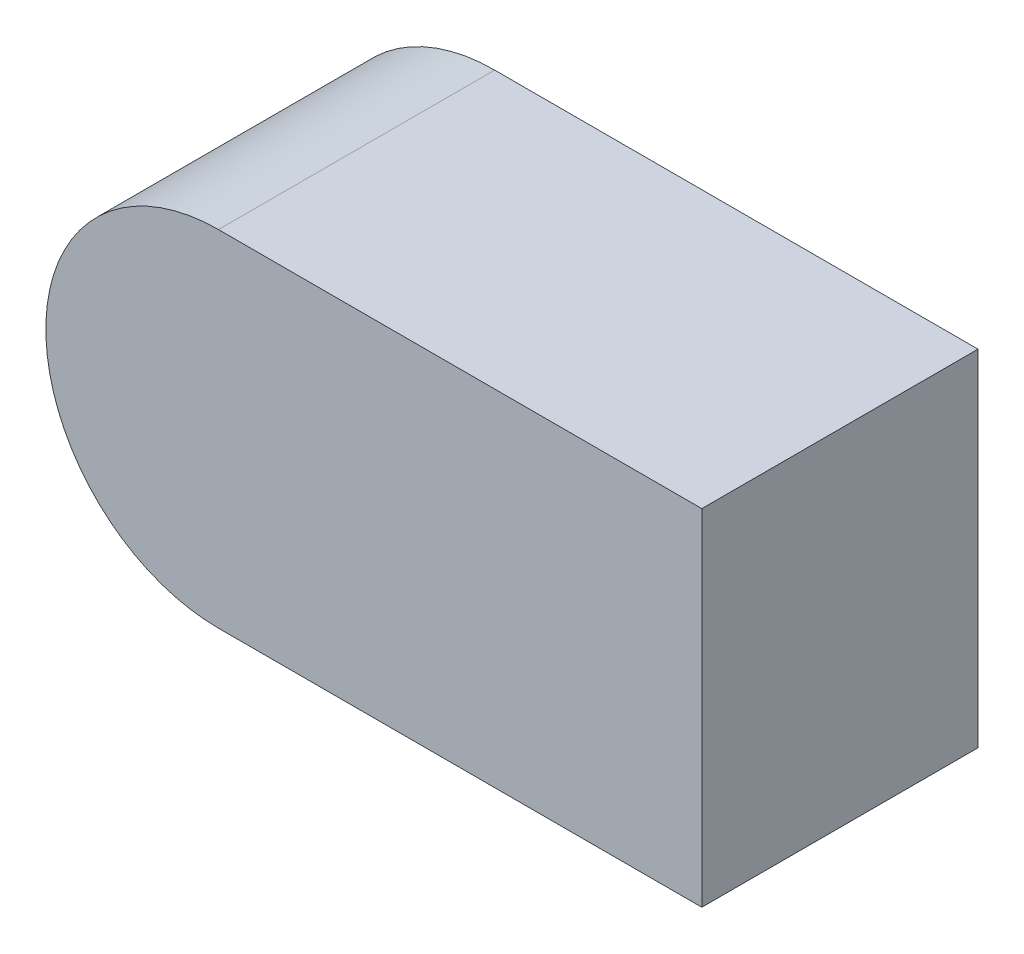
ISO-10303-21;
HEADER;
FILE_DESCRIPTION(('STEP AP214'),'2;1');
FILE_NAME('part.step','',(''),(''),'','','');
FILE_SCHEMA(('AUTOMOTIVE_DESIGN { 1 0 10303 214 1 1 1 1 }'));
ENDSEC;
DATA;
#1=APPLICATION_CONTEXT('core data for automotive mechanical design processes');
#2=APPLICATION_PROTOCOL_DEFINITION('international standard','automotive_design',2000,#1);
#3=PRODUCT_CONTEXT('',#1,'mechanical');
#4=PRODUCT('Part','Part','',(#3));
#5=PRODUCT_RELATED_PRODUCT_CATEGORY('part','',(#4));
#6=PRODUCT_DEFINITION_FORMATION('','',#4);
#7=PRODUCT_DEFINITION_CONTEXT('part definition',#1,'design');
#8=PRODUCT_DEFINITION('design','',#6,#7);
#9=PRODUCT_DEFINITION_SHAPE('','',#8);
#10=(LENGTH_UNIT() NAMED_UNIT(*) SI_UNIT(.MILLI.,.METRE.));
#11=(NAMED_UNIT(*) PLANE_ANGLE_UNIT() SI_UNIT($,.RADIAN.));
#12=(NAMED_UNIT(*) SI_UNIT($,.STERADIAN.) SOLID_ANGLE_UNIT());
#13=UNCERTAINTY_MEASURE_WITH_UNIT(LENGTH_MEASURE(1.E-05),#10,'distance_accuracy_value','');
#14=(GEOMETRIC_REPRESENTATION_CONTEXT(3) GLOBAL_UNCERTAINTY_ASSIGNED_CONTEXT((#13)) GLOBAL_UNIT_ASSIGNED_CONTEXT((#10,
#11,#12)) REPRESENTATION_CONTEXT('',''));
#15=CARTESIAN_POINT('',(0.,0.,0.));
#16=DIRECTION('',(0.,0.,1.));
#17=DIRECTION('',(1.,0.,0.));
#18=AXIS2_PLACEMENT_3D('',#15,#16,#17);
#19=CARTESIAN_POINT('',(-7.,0.,-8.00000000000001));
#20=DIRECTION('',(0.,0.,1.));
#21=DIRECTION('',(1.,0.,0.));
#22=AXIS2_PLACEMENT_3D('',#19,#20,#21);
#23=CYLINDRICAL_SURFACE('',#22,5.);
#24=CARTESIAN_POINT('',(-7.,0.,0.));
#25=DIRECTION('',(0.,0.,1.));
#26=DIRECTION('',(1.,0.,0.));
#27=AXIS2_PLACEMENT_3D('',#24,#25,#26);
#28=CIRCLE('',#27,5.);
#29=CARTESIAN_POINT('',(-7.,5.,0.));
#30=VERTEX_POINT('',#29);
#31=CARTESIAN_POINT('',(-7.,-5.,0.));
#32=VERTEX_POINT('',#31);
#33=EDGE_CURVE('E71',#30,#32,#28,.T.);
#34=ORIENTED_EDGE('',*,*,#33,.F.);
#35=DIRECTION('',(0.,0.,1.));
#36=VECTOR('',#35,1.);
#37=CARTESIAN_POINT('',(-7.,5.,-8.00000000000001));
#38=LINE('',#37,#36);
#39=CARTESIAN_POINT('',(-7.,5.,-8.00000000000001));
#40=VERTEX_POINT('',#39);
#41=EDGE_CURVE('E11',#40,#30,#38,.T.);
#42=ORIENTED_EDGE('',*,*,#41,.F.);
#43=CARTESIAN_POINT('',(-7.,0.,-8.00000000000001));
#44=DIRECTION('',(0.,0.,1.));
#45=DIRECTION('',(1.,0.,0.));
#46=AXIS2_PLACEMENT_3D('',#43,#44,#45);
#47=CIRCLE('',#46,5.);
#48=CARTESIAN_POINT('',(-6.99999999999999,-5.,-8.00000000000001));
#49=VERTEX_POINT('',#48);
#50=EDGE_CURVE('E73',#40,#49,#47,.T.);
#51=ORIENTED_EDGE('',*,*,#50,.T.);
#52=DIRECTION('',(0.,0.,1.));
#53=VECTOR('',#52,1.);
#54=CARTESIAN_POINT('',(-6.99999999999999,-5.,-8.00000000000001));
#55=LINE('',#54,#53);
#56=EDGE_CURVE('E34',#49,#32,#55,.T.);
#57=ORIENTED_EDGE('',*,*,#56,.T.);
#58=EDGE_LOOP('',(#34,#42,#51,#57));
#59=FACE_BOUND('',#58,.T.);
#60=ADVANCED_FACE('F31',(#59),#23,.T.);
#61=CARTESIAN_POINT('',(-7.,5.,-8.00000000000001));
#62=DIRECTION('',(0.,1.,0.));
#63=DIRECTION('',(0.,0.,1.));
#64=AXIS2_PLACEMENT_3D('',#61,#62,#63);
#65=PLANE('',#64);
#66=DIRECTION('',(-1.,0.,0.));
#67=VECTOR('',#66,1.);
#68=CARTESIAN_POINT('',(-7.,5.,0.));
#69=LINE('',#68,#67);
#70=CARTESIAN_POINT('',(7.,5.,0.));
#71=VERTEX_POINT('',#70);
#72=EDGE_CURVE('E88',#71,#30,#69,.T.);
#73=ORIENTED_EDGE('',*,*,#72,.F.);
#74=DIRECTION('',(0.,0.,1.));
#75=VECTOR('',#74,1.);
#76=CARTESIAN_POINT('',(7.,5.,-8.00000000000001));
#77=LINE('',#76,#75);
#78=CARTESIAN_POINT('',(7.,5.,-8.00000000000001));
#79=VERTEX_POINT('',#78);
#80=EDGE_CURVE('E39',#79,#71,#77,.T.);
#81=ORIENTED_EDGE('',*,*,#80,.F.);
#82=DIRECTION('',(-1.,0.,0.));
#83=VECTOR('',#82,1.);
#84=CARTESIAN_POINT('',(-7.,5.,-8.00000000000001));
#85=LINE('',#84,#83);
#86=EDGE_CURVE('E78',#79,#40,#85,.T.);
#87=ORIENTED_EDGE('',*,*,#86,.T.);
#88=ORIENTED_EDGE('',*,*,#41,.T.);
#89=EDGE_LOOP('',(#73,#81,#87,#88));
#90=FACE_BOUND('',#89,.T.);
#91=ADVANCED_FACE('F103',(#90),#65,.T.);
#92=CARTESIAN_POINT('',(7.,5.,-8.00000000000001));
#93=DIRECTION('',(1.,0.,0.));
#94=DIRECTION('',(0.,1.,0.));
#95=AXIS2_PLACEMENT_3D('',#92,#93,#94);
#96=PLANE('',#95);
#97=DIRECTION('',(0.,1.,0.));
#98=VECTOR('',#97,1.);
#99=CARTESIAN_POINT('',(7.,5.,0.));
#100=LINE('',#99,#98);
#101=CARTESIAN_POINT('',(7.,-5.,0.));
#102=VERTEX_POINT('',#101);
#103=EDGE_CURVE('E85',#102,#71,#100,.T.);
#104=ORIENTED_EDGE('',*,*,#103,.F.);
#105=DIRECTION('',(0.,0.,1.));
#106=VECTOR('',#105,1.);
#107=CARTESIAN_POINT('',(7.00000000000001,-5.,-8.00000000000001));
#108=LINE('',#107,#106);
#109=CARTESIAN_POINT('',(7.00000000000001,-5.,-8.00000000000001));
#110=VERTEX_POINT('',#109);
#111=EDGE_CURVE('E77',#110,#102,#108,.T.);
#112=ORIENTED_EDGE('',*,*,#111,.F.);
#113=DIRECTION('',(0.,1.,0.));
#114=VECTOR('',#113,1.);
#115=CARTESIAN_POINT('',(7.,5.,-8.00000000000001));
#116=LINE('',#115,#114);
#117=EDGE_CURVE('E96',#110,#79,#116,.T.);
#118=ORIENTED_EDGE('',*,*,#117,.T.);
#119=ORIENTED_EDGE('',*,*,#80,.T.);
#120=EDGE_LOOP('',(#104,#112,#118,#119));
#121=FACE_BOUND('',#120,.T.);
#122=ADVANCED_FACE('F100',(#121),#96,.T.);
#123=CARTESIAN_POINT('',(-6.99999999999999,-5.,-8.00000000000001));
#124=DIRECTION('',(0.,-1.,0.));
#125=DIRECTION('',(0.,0.,-1.));
#126=AXIS2_PLACEMENT_3D('',#123,#124,#125);
#127=PLANE('',#126);
#128=DIRECTION('',(1.,0.,0.));
#129=VECTOR('',#128,1.);
#130=CARTESIAN_POINT('',(-7.,-5.,0.));
#131=LINE('',#130,#129);
#132=EDGE_CURVE('E80',#32,#102,#131,.T.);
#133=ORIENTED_EDGE('',*,*,#132,.F.);
#134=ORIENTED_EDGE('',*,*,#56,.F.);
#135=DIRECTION('',(1.,0.,0.));
#136=VECTOR('',#135,1.);
#137=CARTESIAN_POINT('',(-6.99999999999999,-5.,-8.00000000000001));
#138=LINE('',#137,#136);
#139=EDGE_CURVE('E94',#49,#110,#138,.T.);
#140=ORIENTED_EDGE('',*,*,#139,.T.);
#141=ORIENTED_EDGE('',*,*,#111,.T.);
#142=EDGE_LOOP('',(#133,#134,#140,#141));
#143=FACE_BOUND('',#142,.T.);
#144=ADVANCED_FACE('F81',(#143),#127,.T.);
#145=CARTESIAN_POINT('',(-7.,0.,-8.00000000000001));
#146=DIRECTION('',(0.,0.,1.));
#147=DIRECTION('',(1.,0.,0.));
#148=AXIS2_PLACEMENT_3D('',#145,#146,#147);
#149=PLANE('',#148);
#150=ORIENTED_EDGE('',*,*,#50,.F.);
#151=ORIENTED_EDGE('',*,*,#86,.F.);
#152=ORIENTED_EDGE('',*,*,#117,.F.);
#153=ORIENTED_EDGE('',*,*,#139,.F.);
#154=EDGE_LOOP('',(#150,#151,#152,#153));
#155=FACE_BOUND('',#154,.T.);
#156=ADVANCED_FACE('F105',(#155),#149,.F.);
#157=CARTESIAN_POINT('',(-7.,0.,0.));
#158=DIRECTION('',(0.,0.,1.));
#159=DIRECTION('',(1.,0.,0.));
#160=AXIS2_PLACEMENT_3D('',#157,#158,#159);
#161=PLANE('',#160);
#162=ORIENTED_EDGE('',*,*,#33,.T.);
#163=ORIENTED_EDGE('',*,*,#132,.T.);
#164=ORIENTED_EDGE('',*,*,#103,.T.);
#165=ORIENTED_EDGE('',*,*,#72,.T.);
#166=EDGE_LOOP('',(#162,#163,#164,#165));
#167=FACE_BOUND('',#166,.T.);
#168=ADVANCED_FACE('F87',(#167),#161,.T.);
#169=CLOSED_SHELL('',(#60,#91,#122,#144,#156,#168));
#170=MANIFOLD_SOLID_BREP('B2',#169);
#171=ADVANCED_BREP_SHAPE_REPRESENTATION('',(#18,#170),#14);
#172=SHAPE_DEFINITION_REPRESENTATION(#9,#171);
ENDSEC;
END-ISO-10303-21;
